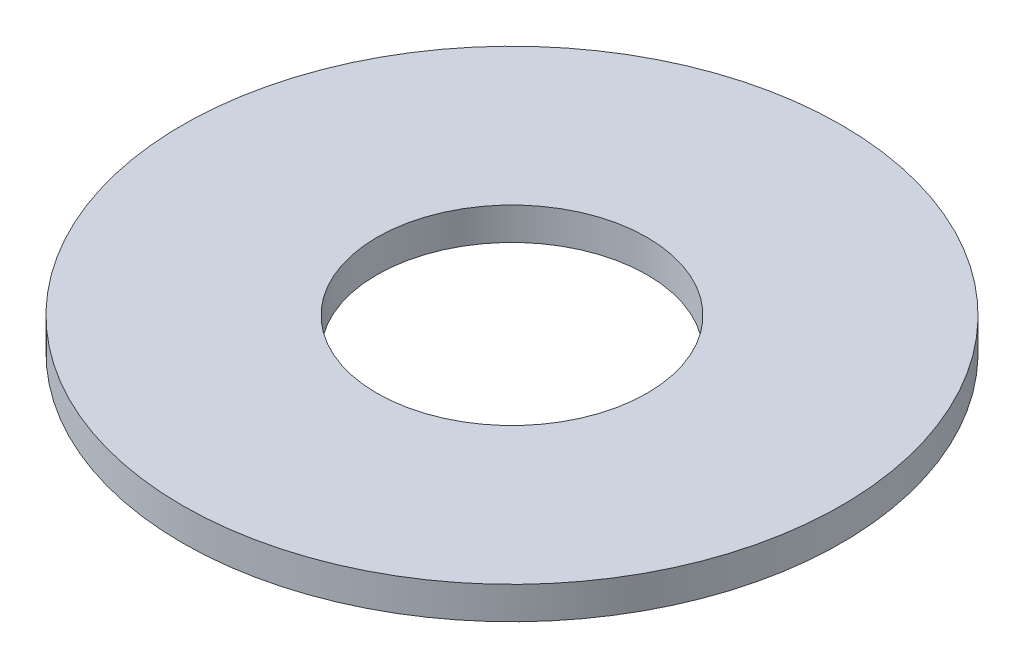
ISO-10303-21;
HEADER;
FILE_DESCRIPTION(('STEP AP214'),'2;1');
FILE_NAME('part.step','',(''),(''),'','','');
FILE_SCHEMA(('AUTOMOTIVE_DESIGN { 1 0 10303 214 1 1 1 1 }'));
ENDSEC;
DATA;
#1=APPLICATION_CONTEXT('core data for automotive mechanical design processes');
#2=APPLICATION_PROTOCOL_DEFINITION('international standard','automotive_design',2000,#1);
#3=PRODUCT_CONTEXT('',#1,'mechanical');
#4=PRODUCT('Part','Part','',(#3));
#5=PRODUCT_RELATED_PRODUCT_CATEGORY('part','',(#4));
#6=PRODUCT_DEFINITION_FORMATION('','',#4);
#7=PRODUCT_DEFINITION_CONTEXT('part definition',#1,'design');
#8=PRODUCT_DEFINITION('design','',#6,#7);
#9=PRODUCT_DEFINITION_SHAPE('','',#8);
#10=(LENGTH_UNIT() NAMED_UNIT(*) SI_UNIT(.MILLI.,.METRE.));
#11=(NAMED_UNIT(*) PLANE_ANGLE_UNIT() SI_UNIT($,.RADIAN.));
#12=(NAMED_UNIT(*) SI_UNIT($,.STERADIAN.) SOLID_ANGLE_UNIT());
#13=UNCERTAINTY_MEASURE_WITH_UNIT(LENGTH_MEASURE(1.E-05),#10,'distance_accuracy_value','');
#14=(GEOMETRIC_REPRESENTATION_CONTEXT(3) GLOBAL_UNCERTAINTY_ASSIGNED_CONTEXT((#13)) GLOBAL_UNIT_ASSIGNED_CONTEXT((#10,
#11,#12)) REPRESENTATION_CONTEXT('',''));
#15=CARTESIAN_POINT('',(0.,0.,0.));
#16=DIRECTION('',(0.,0.,1.));
#17=DIRECTION('',(1.,0.,0.));
#18=AXIS2_PLACEMENT_3D('',#15,#16,#17);
#19=CARTESIAN_POINT('',(0.,40.,0.));
#20=DIRECTION('',(0.,1.,0.));
#21=DIRECTION('',(0.,0.,1.));
#22=AXIS2_PLACEMENT_3D('',#19,#20,#21);
#23=CYLINDRICAL_SURFACE('',#22,6.25000000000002);
#24=CARTESIAN_POINT('',(0.,0.,0.));
#25=DIRECTION('',(0.,1.,0.));
#26=DIRECTION('',(0.,0.,1.));
#27=AXIS2_PLACEMENT_3D('',#24,#25,#26);
#28=CIRCLE('',#27,6.25);
#29=CARTESIAN_POINT('',(0.,0.,6.25));
#30=VERTEX_POINT('',#29);
#31=EDGE_CURVE('E363',#30,#30,#28,.T.);
#32=ORIENTED_EDGE('',*,*,#31,.F.);
#33=EDGE_LOOP('',(#32));
#34=FACE_BOUND('',#33,.T.);
#35=CARTESIAN_POINT('',(0.,1.50000000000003,0.));
#36=DIRECTION('',(0.,1.,0.));
#37=DIRECTION('',(0.,0.,1.));
#38=AXIS2_PLACEMENT_3D('',#35,#36,#37);
#39=CIRCLE('',#38,6.25000000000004);
#40=CARTESIAN_POINT('',(0.,1.50000000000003,6.25000000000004));
#41=VERTEX_POINT('',#40);
#42=EDGE_CURVE('E10',#41,#41,#39,.T.);
#43=ORIENTED_EDGE('',*,*,#42,.T.);
#44=EDGE_LOOP('',(#43));
#45=FACE_BOUND('',#44,.T.);
#46=ADVANCED_FACE('F349',(#34,#45),#23,.F.);
#47=CARTESIAN_POINT('',(15.25,1.5,0.));
#48=DIRECTION('',(0.,-1.,0.));
#49=DIRECTION('',(0.,0.,-1.));
#50=AXIS2_PLACEMENT_3D('',#47,#48,#49);
#51=PLANE('',#50);
#52=ORIENTED_EDGE('',*,*,#42,.F.);
#53=EDGE_LOOP('',(#52));
#54=FACE_BOUND('',#53,.T.);
#55=CARTESIAN_POINT('',(0.,1.5,0.));
#56=DIRECTION('',(0.,1.,0.));
#57=DIRECTION('',(0.,0.,1.));
#58=AXIS2_PLACEMENT_3D('',#55,#56,#57);
#59=CIRCLE('',#58,15.25);
#60=CARTESIAN_POINT('',(0.,1.5,15.25));
#61=VERTEX_POINT('',#60);
#62=EDGE_CURVE('E355',#61,#61,#59,.T.);
#63=ORIENTED_EDGE('',*,*,#62,.T.);
#64=EDGE_LOOP('',(#63));
#65=FACE_BOUND('',#64,.T.);
#66=ADVANCED_FACE('F372',(#54,#65),#51,.F.);
#67=CARTESIAN_POINT('',(0.,40.,0.));
#68=DIRECTION('',(0.,1.,0.));
#69=DIRECTION('',(0.,0.,1.));
#70=AXIS2_PLACEMENT_3D('',#67,#68,#69);
#71=CYLINDRICAL_SURFACE('',#70,15.25);
#72=ORIENTED_EDGE('',*,*,#62,.F.);
#73=EDGE_LOOP('',(#72));
#74=FACE_BOUND('',#73,.T.);
#75=CARTESIAN_POINT('',(0.,0.,0.));
#76=DIRECTION('',(0.,1.,0.));
#77=DIRECTION('',(0.,0.,1.));
#78=AXIS2_PLACEMENT_3D('',#75,#76,#77);
#79=CIRCLE('',#78,15.25);
#80=CARTESIAN_POINT('',(0.,0.,15.25));
#81=VERTEX_POINT('',#80);
#82=EDGE_CURVE('E359',#81,#81,#79,.T.);
#83=ORIENTED_EDGE('',*,*,#82,.T.);
#84=EDGE_LOOP('',(#83));
#85=FACE_BOUND('',#84,.T.);
#86=ADVANCED_FACE('F376',(#74,#85),#71,.T.);
#87=CARTESIAN_POINT('',(6.25000000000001,0.,0.));
#88=DIRECTION('',(0.,1.,0.));
#89=DIRECTION('',(0.,0.,1.));
#90=AXIS2_PLACEMENT_3D('',#87,#88,#89);
#91=PLANE('',#90);
#92=ORIENTED_EDGE('',*,*,#82,.F.);
#93=EDGE_LOOP('',(#92));
#94=FACE_BOUND('',#93,.T.);
#95=ORIENTED_EDGE('',*,*,#31,.T.);
#96=EDGE_LOOP('',(#95));
#97=FACE_BOUND('',#96,.T.);
#98=ADVANCED_FACE('F369',(#94,#97),#91,.F.);
#99=CLOSED_SHELL('',(#46,#66,#86,#98));
#100=MANIFOLD_SOLID_BREP('B2',#99);
#101=ADVANCED_BREP_SHAPE_REPRESENTATION('',(#18,#100),#14);
#102=SHAPE_DEFINITION_REPRESENTATION(#9,#101);
ENDSEC;
END-ISO-10303-21;
